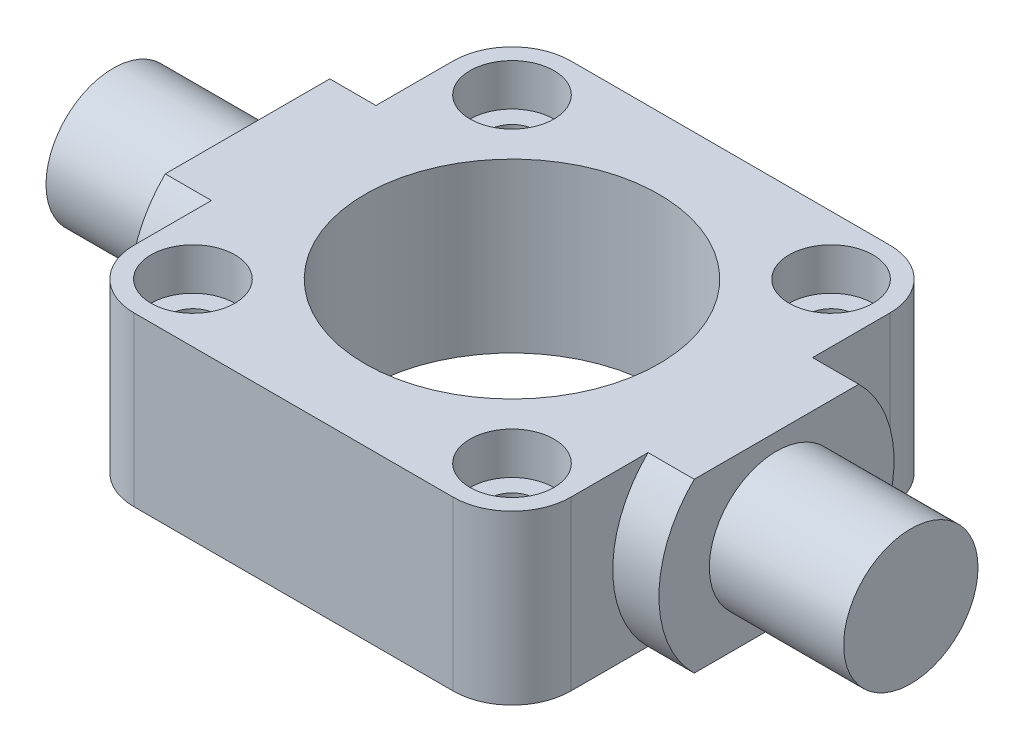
from build123d import *

# Parameters (mm, degrees)
ESQUISSE1_R                                        = 17.5
EXTRUSION1_DEPTH                                   = 20
ESQUISSE2_R                                        = 14
EXTRUSION2_DEPTH                                   = 21.5
EXTRUSION3_START                                   = 21.5
ESQUISSE3_R                                        = 14
EXTRUSION3_DEPTH                                   = 21.5
ESQUISSE4_W                                        = 52
ESQUISSE4_H                                        = 10
ENL_V_MAT_EXTRU_1_DEPTH                            = 102.375539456
ESQUISSE5_OUTSIDE_W                                = 76.026
ESQUISSE5_OUTSIDE_H                                = 44.026
ESQUISSE5_OUTSIDE_R                                = 8
ENL_V_MAT_EXTRU_4_DEPTH                            = 16
ESQUISSE6_OUTSIDE_W                                = 76.026
ESQUISSE6_OUTSIDE_H                                = 44.026
ESQUISSE6_OUTSIDE_R                                = 8
ENL_V_MAT_EXTRU_5_DEPTH                            = 16
CHAMBRAGE_POUR_VIS_T_TE_HEXAGONALE_M51_D           = 5.5
CHAMBRAGE_POUR_VIS_T_TE_HEXAGONALE_M51_CBORE_D     = 10
CHAMBRAGE_POUR_VIS_T_TE_HEXAGONALE_M51_CBORE_DEPTH = 5


with BuildPart() as part:
    # Esquisse1 → Extrusion1 (new body)
    with BuildSketch(Plane(origin=(0, 0, 0), x_dir=(1, 0, 0), z_dir=(0, 1, 0))):
        with BuildLine():
            Line((-19, -26), (19, -26))
            ThreePointArc((19, -26), (23.949747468, -23.949747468), (26, -19))
            Line((26, -19), (26, 19))
            ThreePointArc((26, 19), (23.949747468, 23.949747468), (19, 26))
            Line((19, 26), (-19, 26))
            ThreePointArc((-19, 26), (-23.949747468, 23.949747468), (-26, 19))
            Line((-26, 19), (-26, -19))
            ThreePointArc((-26, -19), (-23.949747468, -23.949747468), (-19, -26))
        make_face()
        with Locations(Location((0, 0, 0), (0, 0, 270))):
            Circle(ESQUISSE1_R, mode=Mode.SUBTRACT)
    extrude(amount=EXTRUSION1_DEPTH)

    # Esquisse2 → Extrusion2 (add)
    with BuildSketch(Plane(origin=(26, 0, 0), x_dir=(0, 0, -1), z_dir=(1, 0, 0))):
        with Locations(Location((0, 10, 0), (0, 0, 134.415308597))):
            Circle(ESQUISSE2_R)
    extrude(amount=EXTRUSION2_DEPTH)

    # Esquisse3 → Extrusion3 (add)
    with BuildSketch(Plane.ZY.offset(26).offset(EXTRUSION3_START)):
        with Locations(Location((0, 10, 0), (0, 0, 45.584691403))):
            Circle(ESQUISSE3_R)
    extrude(amount=-EXTRUSION3_DEPTH)

    # Esquisse4 → Enl_v. mat.-Extru.1 (cut, through all)
    with BuildSketch(Plane.ZY.offset(47.5)):
        with Locations((0, 25)):
            Rectangle(ESQUISSE4_W, ESQUISSE4_H)
        with Locations((0, -5)):
            Rectangle(ESQUISSE4_W, ESQUISSE4_H)
    extrude(amount=-ENL_V_MAT_EXTRU_1_DEPTH, mode=Mode.SUBTRACT)

    # Esquisse5 outside → Enl_v. mat.-Extru.4 (cut)
    with BuildSketch(Plane.ZY.offset(47.5)):
        with Locations((0, 10)):
            Rectangle(ESQUISSE5_OUTSIDE_W, ESQUISSE5_OUTSIDE_H)
        with Locations((0, 10)):
            Circle(ESQUISSE5_OUTSIDE_R, mode=Mode.SUBTRACT)
    extrude(amount=-ENL_V_MAT_EXTRU_4_DEPTH, mode=Mode.SUBTRACT)

    # Esquisse6 outside → Enl_v. mat.-Extru.5 (cut)
    with BuildSketch(Plane(origin=(47.5, 0, 0), x_dir=(0, 0, -1), z_dir=(1, 0, 0))):
        with Locations((0, 10)):
            Rectangle(ESQUISSE6_OUTSIDE_W, ESQUISSE6_OUTSIDE_H)
        with Locations(Location((0, 10, 0), (0, 0, 180))):
            Circle(ESQUISSE6_OUTSIDE_R, mode=Mode.SUBTRACT)
    extrude(amount=-ENL_V_MAT_EXTRU_5_DEPTH, mode=Mode.SUBTRACT)

    # Chambrage pour vis _ t_te hexagonale M51 (through all)
    with Locations(Plane(origin=(0, 20, 0), x_dir=(-1, 0, 0), z_dir=(0, 1, 0))):
        with Locations((19, -19), (-19, -19), (-19, 19), (19, 19)):
            CounterBoreHole(CHAMBRAGE_POUR_VIS_T_TE_HEXAGONALE_M51_D / 2, CHAMBRAGE_POUR_VIS_T_TE_HEXAGONALE_M51_CBORE_D / 2, CHAMBRAGE_POUR_VIS_T_TE_HEXAGONALE_M51_CBORE_DEPTH)


solid = part.part
